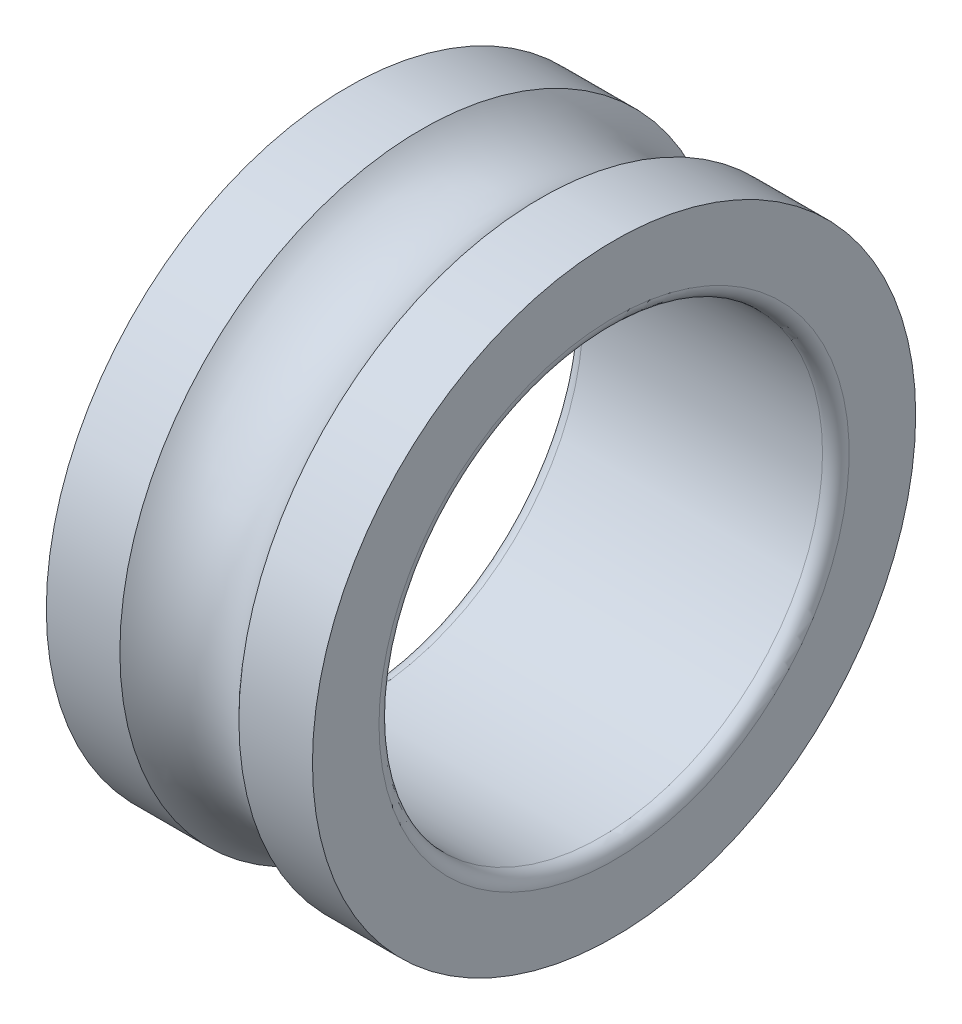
ISO-10303-21;
HEADER;
FILE_DESCRIPTION(('STEP AP214'),'2;1');
FILE_NAME('part.step','',(''),(''),'','','');
FILE_SCHEMA(('AUTOMOTIVE_DESIGN { 1 0 10303 214 1 1 1 1 }'));
ENDSEC;
DATA;
#1=APPLICATION_CONTEXT('core data for automotive mechanical design processes');
#2=APPLICATION_PROTOCOL_DEFINITION('international standard','automotive_design',2000,#1);
#3=PRODUCT_CONTEXT('',#1,'mechanical');
#4=PRODUCT('Part','Part','',(#3));
#5=PRODUCT_RELATED_PRODUCT_CATEGORY('part','',(#4));
#6=PRODUCT_DEFINITION_FORMATION('','',#4);
#7=PRODUCT_DEFINITION_CONTEXT('part definition',#1,'design');
#8=PRODUCT_DEFINITION('design','',#6,#7);
#9=PRODUCT_DEFINITION_SHAPE('','',#8);
#10=(LENGTH_UNIT() NAMED_UNIT(*) SI_UNIT(.MILLI.,.METRE.));
#11=(NAMED_UNIT(*) PLANE_ANGLE_UNIT() SI_UNIT($,.RADIAN.));
#12=(NAMED_UNIT(*) SI_UNIT($,.STERADIAN.) SOLID_ANGLE_UNIT());
#13=UNCERTAINTY_MEASURE_WITH_UNIT(LENGTH_MEASURE(1.E-05),#10,'distance_accuracy_value','');
#14=(GEOMETRIC_REPRESENTATION_CONTEXT(3) GLOBAL_UNCERTAINTY_ASSIGNED_CONTEXT((#13)) GLOBAL_UNIT_ASSIGNED_CONTEXT((#10,
#11,#12)) REPRESENTATION_CONTEXT('',''));
#15=CARTESIAN_POINT('',(0.,0.,0.));
#16=DIRECTION('',(0.,0.,1.));
#17=DIRECTION('',(1.,0.,0.));
#18=AXIS2_PLACEMENT_3D('',#15,#16,#17);
#19=CARTESIAN_POINT('',(0.300000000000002,0.,0.));
#20=DIRECTION('',(-1.,0.,0.));
#21=DIRECTION('',(0.,0.,1.));
#22=AXIS2_PLACEMENT_3D('',#19,#20,#21);
#23=TOROIDAL_SURFACE('',#22,5.3,0.300000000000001);
#24=CARTESIAN_POINT('',(0.300000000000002,0.,0.));
#25=DIRECTION('',(-1.,0.,0.));
#26=DIRECTION('',(0.,0.,1.));
#27=AXIS2_PLACEMENT_3D('',#24,#25,#26);
#28=CIRCLE('',#27,5.);
#29=CARTESIAN_POINT('',(0.300000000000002,0.,5.));
#30=VERTEX_POINT('',#29);
#31=EDGE_CURVE('E10',#30,#30,#28,.T.);
#32=ORIENTED_EDGE('',*,*,#31,.F.);
#33=EDGE_LOOP('',(#32));
#34=FACE_BOUND('',#33,.T.);
#35=CARTESIAN_POINT('',(0.,0.,0.));
#36=DIRECTION('',(-1.,0.,0.));
#37=DIRECTION('',(0.,0.,1.));
#38=AXIS2_PLACEMENT_3D('',#35,#36,#37);
#39=CIRCLE('',#38,5.3);
#40=CARTESIAN_POINT('',(0.,0.,5.3));
#41=VERTEX_POINT('',#40);
#42=EDGE_CURVE('E376',#41,#41,#39,.T.);
#43=ORIENTED_EDGE('',*,*,#42,.T.);
#44=EDGE_LOOP('',(#43));
#45=FACE_BOUND('',#44,.T.);
#46=ADVANCED_FACE('F348',(#34,#45),#23,.T.);
#47=CARTESIAN_POINT('',(0.,0.,0.));
#48=DIRECTION('',(-1.,0.,0.));
#49=DIRECTION('',(0.,0.,1.));
#50=AXIS2_PLACEMENT_3D('',#47,#48,#49);
#51=CYLINDRICAL_SURFACE('',#50,5.);
#52=CARTESIAN_POINT('',(5.7,0.,0.));
#53=DIRECTION('',(-1.,0.,0.));
#54=DIRECTION('',(0.,0.,1.));
#55=AXIS2_PLACEMENT_3D('',#52,#53,#54);
#56=CIRCLE('',#55,5.);
#57=CARTESIAN_POINT('',(5.7,0.,5.));
#58=VERTEX_POINT('',#57);
#59=EDGE_CURVE('E354',#58,#58,#56,.T.);
#60=ORIENTED_EDGE('',*,*,#59,.F.);
#61=EDGE_LOOP('',(#60));
#62=FACE_BOUND('',#61,.T.);
#63=ORIENTED_EDGE('',*,*,#31,.T.);
#64=EDGE_LOOP('',(#63));
#65=FACE_BOUND('',#64,.T.);
#66=ADVANCED_FACE('F413',(#62,#65),#51,.F.);
#67=CARTESIAN_POINT('',(5.7,0.,0.));
#68=DIRECTION('',(-1.,0.,0.));
#69=DIRECTION('',(0.,0.,1.));
#70=AXIS2_PLACEMENT_3D('',#67,#68,#69);
#71=TOROIDAL_SURFACE('',#70,5.3,0.300000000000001);
#72=CARTESIAN_POINT('',(6.,0.,0.));
#73=DIRECTION('',(-1.,0.,0.));
#74=DIRECTION('',(0.,0.,1.));
#75=AXIS2_PLACEMENT_3D('',#72,#73,#74);
#76=CIRCLE('',#75,5.3);
#77=CARTESIAN_POINT('',(6.,0.,5.3));
#78=VERTEX_POINT('',#77);
#79=EDGE_CURVE('E358',#78,#78,#76,.T.);
#80=ORIENTED_EDGE('',*,*,#79,.F.);
#81=EDGE_LOOP('',(#80));
#82=FACE_BOUND('',#81,.T.);
#83=ORIENTED_EDGE('',*,*,#59,.T.);
#84=EDGE_LOOP('',(#83));
#85=FACE_BOUND('',#84,.T.);
#86=ADVANCED_FACE('F408',(#82,#85),#71,.T.);
#87=CARTESIAN_POINT('',(6.,0.,-6.8));
#88=DIRECTION('',(-1.,0.,0.));
#89=DIRECTION('',(0.,0.,1.));
#90=AXIS2_PLACEMENT_3D('',#87,#88,#89);
#91=PLANE('',#90);
#92=CARTESIAN_POINT('',(6.,0.,0.));
#93=DIRECTION('',(-1.,0.,0.));
#94=DIRECTION('',(0.,0.,1.));
#95=AXIS2_PLACEMENT_3D('',#92,#93,#94);
#96=CIRCLE('',#95,6.8);
#97=CARTESIAN_POINT('',(6.,0.,6.8));
#98=VERTEX_POINT('',#97);
#99=EDGE_CURVE('E362',#98,#98,#96,.T.);
#100=ORIENTED_EDGE('',*,*,#99,.F.);
#101=EDGE_LOOP('',(#100));
#102=FACE_BOUND('',#101,.T.);
#103=ORIENTED_EDGE('',*,*,#79,.T.);
#104=EDGE_LOOP('',(#103));
#105=FACE_BOUND('',#104,.T.);
#106=ADVANCED_FACE('F402',(#102,#105),#91,.F.);
#107=CARTESIAN_POINT('',(0.,0.,0.));
#108=DIRECTION('',(-1.,0.,0.));
#109=DIRECTION('',(0.,0.,1.));
#110=AXIS2_PLACEMENT_3D('',#107,#108,#109);
#111=CYLINDRICAL_SURFACE('',#110,6.8);
#112=CARTESIAN_POINT('',(4.34164078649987,0.,0.));
#113=DIRECTION('',(-1.,0.,0.));
#114=DIRECTION('',(0.,0.,1.));
#115=AXIS2_PLACEMENT_3D('',#112,#113,#114);
#116=CIRCLE('',#115,6.8);
#117=CARTESIAN_POINT('',(4.34164078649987,0.,6.8));
#118=VERTEX_POINT('',#117);
#119=EDGE_CURVE('E367',#118,#118,#116,.T.);
#120=ORIENTED_EDGE('',*,*,#119,.F.);
#121=EDGE_LOOP('',(#120));
#122=FACE_BOUND('',#121,.T.);
#123=ORIENTED_EDGE('',*,*,#99,.T.);
#124=EDGE_LOOP('',(#123));
#125=FACE_BOUND('',#124,.T.);
#126=ADVANCED_FACE('F396',(#122,#125),#111,.T.);
#127=CARTESIAN_POINT('',(3.,0.,0.));
#128=DIRECTION('',(-1.,0.,0.));
#129=DIRECTION('',(0.,0.,1.));
#130=AXIS2_PLACEMENT_3D('',#127,#128,#129);
#131=TOROIDAL_SURFACE('',#130,8.,1.8);
#132=CARTESIAN_POINT('',(1.65835921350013,0.,0.));
#133=DIRECTION('',(-1.,0.,0.));
#134=DIRECTION('',(0.,0.,1.));
#135=AXIS2_PLACEMENT_3D('',#132,#133,#134);
#136=CIRCLE('',#135,6.8);
#137=CARTESIAN_POINT('',(1.65835921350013,0.,6.8));
#138=VERTEX_POINT('',#137);
#139=EDGE_CURVE('E370',#138,#138,#136,.T.);
#140=ORIENTED_EDGE('',*,*,#139,.F.);
#141=EDGE_LOOP('',(#140));
#142=FACE_BOUND('',#141,.T.);
#143=ORIENTED_EDGE('',*,*,#119,.T.);
#144=EDGE_LOOP('',(#143));
#145=FACE_BOUND('',#144,.T.);
#146=ADVANCED_FACE('F390',(#142,#145),#131,.F.);
#147=CARTESIAN_POINT('',(0.,0.,0.));
#148=DIRECTION('',(-1.,0.,0.));
#149=DIRECTION('',(0.,0.,1.));
#150=AXIS2_PLACEMENT_3D('',#147,#148,#149);
#151=CYLINDRICAL_SURFACE('',#150,6.8);
#152=CARTESIAN_POINT('',(0.,0.,0.));
#153=DIRECTION('',(-1.,0.,0.));
#154=DIRECTION('',(0.,0.,1.));
#155=AXIS2_PLACEMENT_3D('',#152,#153,#154);
#156=CIRCLE('',#155,6.8);
#157=CARTESIAN_POINT('',(0.,0.,6.8));
#158=VERTEX_POINT('',#157);
#159=EDGE_CURVE('E373',#158,#158,#156,.T.);
#160=ORIENTED_EDGE('',*,*,#159,.F.);
#161=EDGE_LOOP('',(#160));
#162=FACE_BOUND('',#161,.T.);
#163=ORIENTED_EDGE('',*,*,#139,.T.);
#164=EDGE_LOOP('',(#163));
#165=FACE_BOUND('',#164,.T.);
#166=ADVANCED_FACE('F384',(#162,#165),#151,.T.);
#167=CARTESIAN_POINT('',(0.,0.,-6.8));
#168=DIRECTION('',(1.,0.,0.));
#169=DIRECTION('',(0.,0.,-1.));
#170=AXIS2_PLACEMENT_3D('',#167,#168,#169);
#171=PLANE('',#170);
#172=ORIENTED_EDGE('',*,*,#42,.F.);
#173=EDGE_LOOP('',(#172));
#174=FACE_BOUND('',#173,.T.);
#175=ORIENTED_EDGE('',*,*,#159,.T.);
#176=EDGE_LOOP('',(#175));
#177=FACE_BOUND('',#176,.T.);
#178=ADVANCED_FACE('F381',(#174,#177),#171,.F.);
#179=CLOSED_SHELL('',(#46,#66,#86,#106,#126,#146,#166,#178));
#180=MANIFOLD_SOLID_BREP('B2',#179);
#181=ADVANCED_BREP_SHAPE_REPRESENTATION('',(#18,#180),#14);
#182=SHAPE_DEFINITION_REPRESENTATION(#9,#181);
ENDSEC;
END-ISO-10303-21;
